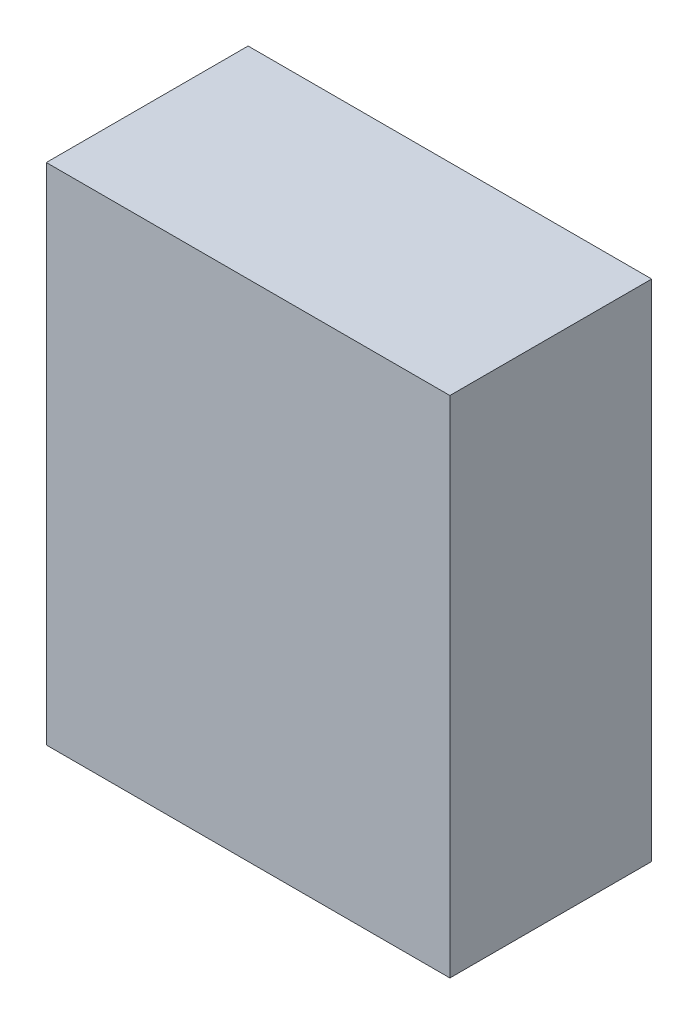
ISO-10303-21;
HEADER;
FILE_DESCRIPTION(('STEP AP214'),'2;1');
FILE_NAME('part.step','',(''),(''),'','','');
FILE_SCHEMA(('AUTOMOTIVE_DESIGN { 1 0 10303 214 1 1 1 1 }'));
ENDSEC;
DATA;
#1=APPLICATION_CONTEXT('core data for automotive mechanical design processes');
#2=APPLICATION_PROTOCOL_DEFINITION('international standard','automotive_design',2000,#1);
#3=PRODUCT_CONTEXT('',#1,'mechanical');
#4=PRODUCT('Part','Part','',(#3));
#5=PRODUCT_RELATED_PRODUCT_CATEGORY('part','',(#4));
#6=PRODUCT_DEFINITION_FORMATION('','',#4);
#7=PRODUCT_DEFINITION_CONTEXT('part definition',#1,'design');
#8=PRODUCT_DEFINITION('design','',#6,#7);
#9=PRODUCT_DEFINITION_SHAPE('','',#8);
#10=(LENGTH_UNIT() NAMED_UNIT(*) SI_UNIT(.MILLI.,.METRE.));
#11=(NAMED_UNIT(*) PLANE_ANGLE_UNIT() SI_UNIT($,.RADIAN.));
#12=(NAMED_UNIT(*) SI_UNIT($,.STERADIAN.) SOLID_ANGLE_UNIT());
#13=UNCERTAINTY_MEASURE_WITH_UNIT(LENGTH_MEASURE(1.E-05),#10,'distance_accuracy_value','');
#14=(GEOMETRIC_REPRESENTATION_CONTEXT(3) GLOBAL_UNCERTAINTY_ASSIGNED_CONTEXT((#13)) GLOBAL_UNIT_ASSIGNED_CONTEXT((#10,
#11,#12)) REPRESENTATION_CONTEXT('',''));
#15=CARTESIAN_POINT('',(0.,0.,0.));
#16=DIRECTION('',(0.,0.,1.));
#17=DIRECTION('',(1.,0.,0.));
#18=AXIS2_PLACEMENT_3D('',#15,#16,#17);
#19=CARTESIAN_POINT('',(0.,0.,1.00000054));
#20=DIRECTION('',(0.,0.,-1.));
#21=DIRECTION('',(0.,-1.,0.));
#22=AXIS2_PLACEMENT_3D('',#19,#20,#21);
#23=PLANE('',#22);
#24=DIRECTION('',(-1.,0.,0.));
#25=VECTOR('',#24,1.);
#26=CARTESIAN_POINT('',(1.00000054,-1.25000004,1.00000054));
#27=LINE('',#26,#25);
#28=CARTESIAN_POINT('',(1.00000054,-1.25000004,1.00000054));
#29=VERTEX_POINT('',#28);
#30=CARTESIAN_POINT('',(-1.00000054,-1.25000004,1.00000054));
#31=VERTEX_POINT('',#30);
#32=EDGE_CURVE('E20',#29,#31,#27,.T.);
#33=ORIENTED_EDGE('',*,*,#32,.F.);
#34=DIRECTION('',(0.,-1.,0.));
#35=VECTOR('',#34,1.);
#36=CARTESIAN_POINT('',(1.00000054,1.25000004,1.00000054));
#37=LINE('',#36,#35);
#38=CARTESIAN_POINT('',(1.00000054,1.25000004,1.00000054));
#39=VERTEX_POINT('',#38);
#40=EDGE_CURVE('E103',#39,#29,#37,.T.);
#41=ORIENTED_EDGE('',*,*,#40,.F.);
#42=DIRECTION('',(1.,0.,0.));
#43=VECTOR('',#42,1.);
#44=CARTESIAN_POINT('',(-1.00000054,1.25000004,1.00000054));
#45=LINE('',#44,#43);
#46=CARTESIAN_POINT('',(-1.00000054,1.25000004,1.00000054));
#47=VERTEX_POINT('',#46);
#48=EDGE_CURVE('E84',#47,#39,#45,.T.);
#49=ORIENTED_EDGE('',*,*,#48,.F.);
#50=DIRECTION('',(0.,1.,0.));
#51=VECTOR('',#50,1.);
#52=CARTESIAN_POINT('',(-1.00000054,-1.25000004,1.00000054));
#53=LINE('',#52,#51);
#54=EDGE_CURVE('E88',#31,#47,#53,.T.);
#55=ORIENTED_EDGE('',*,*,#54,.F.);
#56=EDGE_LOOP('',(#33,#41,#49,#55));
#57=FACE_BOUND('',#56,.T.);
#58=ADVANCED_FACE('F17',(#57),#23,.F.);
#59=CARTESIAN_POINT('',(0.,0.,0.));
#60=DIRECTION('',(0.,0.,-1.));
#61=DIRECTION('',(0.,-1.,0.));
#62=AXIS2_PLACEMENT_3D('',#59,#60,#61);
#63=PLANE('',#62);
#64=DIRECTION('',(0.,1.,0.));
#65=VECTOR('',#64,1.);
#66=CARTESIAN_POINT('',(-1.00000054,-1.25000004,0.));
#67=LINE('',#66,#65);
#68=CARTESIAN_POINT('',(-1.00000054,-1.25000004,0.));
#69=VERTEX_POINT('',#68);
#70=CARTESIAN_POINT('',(-1.00000054,1.25000004,0.));
#71=VERTEX_POINT('',#70);
#72=EDGE_CURVE('E72',#69,#71,#67,.T.);
#73=ORIENTED_EDGE('',*,*,#72,.T.);
#74=DIRECTION('',(1.,0.,0.));
#75=VECTOR('',#74,1.);
#76=CARTESIAN_POINT('',(-1.00000054,1.25000004,0.));
#77=LINE('',#76,#75);
#78=CARTESIAN_POINT('',(1.00000054,1.25000004,0.));
#79=VERTEX_POINT('',#78);
#80=EDGE_CURVE('E111',#71,#79,#77,.T.);
#81=ORIENTED_EDGE('',*,*,#80,.T.);
#82=DIRECTION('',(0.,-1.,0.));
#83=VECTOR('',#82,1.);
#84=CARTESIAN_POINT('',(1.00000054,1.25000004,0.));
#85=LINE('',#84,#83);
#86=CARTESIAN_POINT('',(1.00000054,-1.25000004,0.));
#87=VERTEX_POINT('',#86);
#88=EDGE_CURVE('E74',#79,#87,#85,.T.);
#89=ORIENTED_EDGE('',*,*,#88,.T.);
#90=DIRECTION('',(-1.,0.,0.));
#91=VECTOR('',#90,1.);
#92=CARTESIAN_POINT('',(1.00000054,-1.25000004,0.));
#93=LINE('',#92,#91);
#94=EDGE_CURVE('E11',#87,#69,#93,.T.);
#95=ORIENTED_EDGE('',*,*,#94,.T.);
#96=EDGE_LOOP('',(#73,#81,#89,#95));
#97=FACE_BOUND('',#96,.T.);
#98=ADVANCED_FACE('F70',(#97),#63,.T.);
#99=CARTESIAN_POINT('',(1.00000054,-1.25000004,0.));
#100=DIRECTION('',(0.,-1.,0.));
#101=DIRECTION('',(0.,0.,-1.));
#102=AXIS2_PLACEMENT_3D('',#99,#100,#101);
#103=PLANE('',#102);
#104=DIRECTION('',(0.,0.,1.));
#105=VECTOR('',#104,1.);
#106=CARTESIAN_POINT('',(1.00000054,-1.25000004,0.));
#107=LINE('',#106,#105);
#108=EDGE_CURVE('E97',#87,#29,#107,.T.);
#109=ORIENTED_EDGE('',*,*,#108,.T.);
#110=ORIENTED_EDGE('',*,*,#32,.T.);
#111=DIRECTION('',(0.,0.,1.));
#112=VECTOR('',#111,1.);
#113=CARTESIAN_POINT('',(-1.00000054,-1.25000004,0.));
#114=LINE('',#113,#112);
#115=EDGE_CURVE('E80',#69,#31,#114,.T.);
#116=ORIENTED_EDGE('',*,*,#115,.F.);
#117=ORIENTED_EDGE('',*,*,#94,.F.);
#118=EDGE_LOOP('',(#109,#110,#116,#117));
#119=FACE_BOUND('',#118,.T.);
#120=ADVANCED_FACE('F86',(#119),#103,.T.);
#121=CARTESIAN_POINT('',(1.00000054,1.25000004,0.));
#122=DIRECTION('',(1.,0.,0.));
#123=DIRECTION('',(0.,1.,0.));
#124=AXIS2_PLACEMENT_3D('',#121,#122,#123);
#125=PLANE('',#124);
#126=DIRECTION('',(0.,0.,1.));
#127=VECTOR('',#126,1.);
#128=CARTESIAN_POINT('',(1.00000054,1.25000004,0.));
#129=LINE('',#128,#127);
#130=EDGE_CURVE('E106',#79,#39,#129,.T.);
#131=ORIENTED_EDGE('',*,*,#130,.T.);
#132=ORIENTED_EDGE('',*,*,#40,.T.);
#133=ORIENTED_EDGE('',*,*,#108,.F.);
#134=ORIENTED_EDGE('',*,*,#88,.F.);
#135=EDGE_LOOP('',(#131,#132,#133,#134));
#136=FACE_BOUND('',#135,.T.);
#137=ADVANCED_FACE('F118',(#136),#125,.T.);
#138=CARTESIAN_POINT('',(-1.00000054,1.25000004,0.));
#139=DIRECTION('',(0.,1.,0.));
#140=DIRECTION('',(1.,0.,0.));
#141=AXIS2_PLACEMENT_3D('',#138,#139,#140);
#142=PLANE('',#141);
#143=DIRECTION('',(0.,0.,1.));
#144=VECTOR('',#143,1.);
#145=CARTESIAN_POINT('',(-1.00000054,1.25000004,0.));
#146=LINE('',#145,#144);
#147=EDGE_CURVE('E82',#71,#47,#146,.T.);
#148=ORIENTED_EDGE('',*,*,#147,.T.);
#149=ORIENTED_EDGE('',*,*,#48,.T.);
#150=ORIENTED_EDGE('',*,*,#130,.F.);
#151=ORIENTED_EDGE('',*,*,#80,.F.);
#152=EDGE_LOOP('',(#148,#149,#150,#151));
#153=FACE_BOUND('',#152,.T.);
#154=ADVANCED_FACE('F121',(#153),#142,.T.);
#155=CARTESIAN_POINT('',(-1.00000054,-1.25000004,0.));
#156=DIRECTION('',(-1.,0.,0.));
#157=DIRECTION('',(0.,0.,1.));
#158=AXIS2_PLACEMENT_3D('',#155,#156,#157);
#159=PLANE('',#158);
#160=ORIENTED_EDGE('',*,*,#115,.T.);
#161=ORIENTED_EDGE('',*,*,#54,.T.);
#162=ORIENTED_EDGE('',*,*,#147,.F.);
#163=ORIENTED_EDGE('',*,*,#72,.F.);
#164=EDGE_LOOP('',(#160,#161,#162,#163));
#165=FACE_BOUND('',#164,.T.);
#166=ADVANCED_FACE('F78',(#165),#159,.T.);
#167=CLOSED_SHELL('',(#58,#98,#120,#137,#154,#166));
#168=MANIFOLD_SOLID_BREP('B1',#167);
#169=ADVANCED_BREP_SHAPE_REPRESENTATION('',(#18,#168),#14);
#170=SHAPE_DEFINITION_REPRESENTATION(#9,#169);
ENDSEC;
END-ISO-10303-21;
